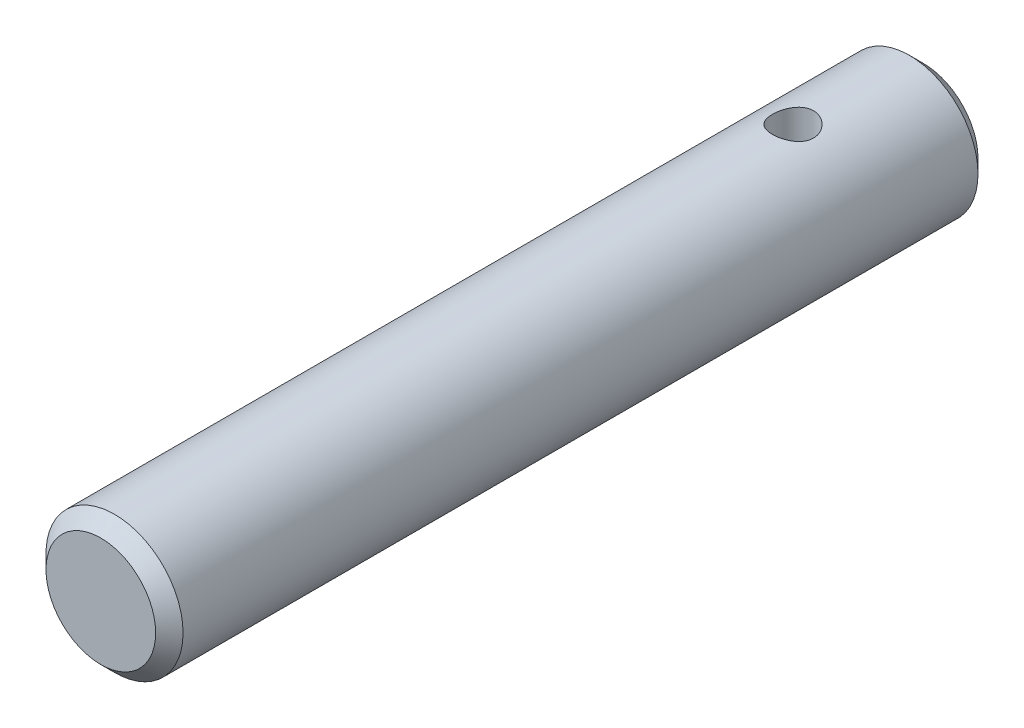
from build123d import *

# Parameters (mm, degrees)
ESQUISSE1_R                  = 10
EXTRUSION1_DEPTH             = 120
CHANFREIN1_SIZE              = 2
ENL_V_MAT_EXTRU_1_DEPTH      = 121.830459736
ENL_V_MAT_EXTRU_1_DEPTH_BACK = 121.830459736
ESQUISSE2_R                  = 3


with BuildPart() as part:
    # Esquisse1 → Extrusion1 (new body)
    with BuildSketch(Plane.XY):
        Circle(ESQUISSE1_R)
    extrude(amount=EXTRUSION1_DEPTH)

    # Chanfrein1
    chanfrein1_edges = [part.edges().sort_by_distance(p)[0] for p in [
        (-10, 0, 0),
        (-10, 0, 120),
    ]]
    chamfer(chanfrein1_edges, length=CHANFREIN1_SIZE)

    # Esquisse2 → Enl_v. mat.-Extru.1 (cut, two sides: drawn at the far end of the back side and taken through both)
    with BuildSketch(Plane(origin=(0, 0, 0), x_dir=(1, 0, 0), z_dir=(0, 1, 0)).offset(-ENL_V_MAT_EXTRU_1_DEPTH_BACK)):
        with Locations(Location((0, -19, 0), (0, 0, 270))):
            Circle(ESQUISSE2_R)
    extrude(amount=ENL_V_MAT_EXTRU_1_DEPTH + ENL_V_MAT_EXTRU_1_DEPTH_BACK, mode=Mode.SUBTRACT)


solid = part.part
